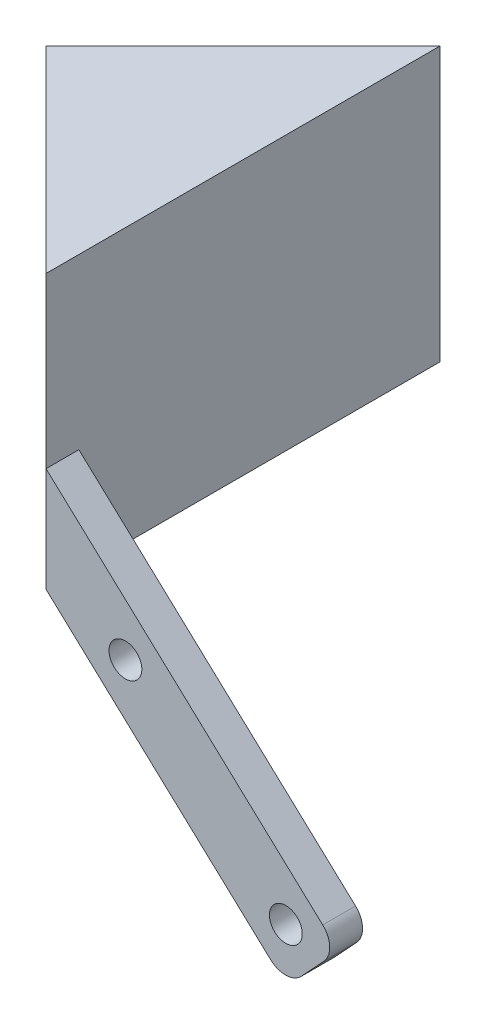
ISO-10303-21;
HEADER;
FILE_DESCRIPTION(('STEP AP214'),'2;1');
FILE_NAME('part.step','',(''),(''),'','','');
FILE_SCHEMA(('AUTOMOTIVE_DESIGN { 1 0 10303 214 1 1 1 1 }'));
ENDSEC;
DATA;
#1=APPLICATION_CONTEXT('core data for automotive mechanical design processes');
#2=APPLICATION_PROTOCOL_DEFINITION('international standard','automotive_design',2000,#1);
#3=PRODUCT_CONTEXT('',#1,'mechanical');
#4=PRODUCT('Part','Part','',(#3));
#5=PRODUCT_RELATED_PRODUCT_CATEGORY('part','',(#4));
#6=PRODUCT_DEFINITION_FORMATION('','',#4);
#7=PRODUCT_DEFINITION_CONTEXT('part definition',#1,'design');
#8=PRODUCT_DEFINITION('design','',#6,#7);
#9=PRODUCT_DEFINITION_SHAPE('','',#8);
#10=(LENGTH_UNIT() NAMED_UNIT(*) SI_UNIT(.MILLI.,.METRE.));
#11=(NAMED_UNIT(*) PLANE_ANGLE_UNIT() SI_UNIT($,.RADIAN.));
#12=(NAMED_UNIT(*) SI_UNIT($,.STERADIAN.) SOLID_ANGLE_UNIT());
#13=UNCERTAINTY_MEASURE_WITH_UNIT(LENGTH_MEASURE(1.E-05),#10,'distance_accuracy_value','');
#14=(GEOMETRIC_REPRESENTATION_CONTEXT(3) GLOBAL_UNCERTAINTY_ASSIGNED_CONTEXT((#13)) GLOBAL_UNIT_ASSIGNED_CONTEXT((#10,
#11,#12)) REPRESENTATION_CONTEXT('',''));
#15=CARTESIAN_POINT('',(0.,0.,0.));
#16=DIRECTION('',(0.,0.,1.));
#17=DIRECTION('',(1.,0.,0.));
#18=AXIS2_PLACEMENT_3D('',#15,#16,#17);
#19=CARTESIAN_POINT('',(0.,0.,3.));
#20=DIRECTION('',(0.,0.,1.));
#21=DIRECTION('',(1.,0.,0.));
#22=AXIS2_PLACEMENT_3D('',#19,#20,#21);
#23=PLANE('',#22);
#24=DIRECTION('',(0.732991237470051,-0.680238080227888,0.));
#25=VECTOR('',#24,1.);
#26=CARTESIAN_POINT('',(-17.467540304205,6.14774777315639,3.));
#27=LINE('',#26,#25);
#28=CARTESIAN_POINT('',(-17.467540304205,6.14774777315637,3.));
#29=VERTEX_POINT('',#28);
#30=CARTESIAN_POINT('',(3.05621434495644,-12.8989184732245,3.));
#31=VERTEX_POINT('',#30);
#32=EDGE_CURVE('E168',#29,#31,#27,.T.);
#33=ORIENTED_EDGE('',*,*,#32,.T.);
#34=CARTESIAN_POINT('',(4.41669050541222,-11.4329359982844,3.));
#35=DIRECTION('',(0.,0.,1.));
#36=DIRECTION('',(1.,0.,0.));
#37=AXIS2_PLACEMENT_3D('',#34,#35,#36);
#38=CIRCLE('',#37,2.);
#39=CARTESIAN_POINT('',(5.88267298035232,-12.7934121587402,3.));
#40=VERTEX_POINT('',#39);
#41=EDGE_CURVE('E48',#31,#40,#38,.T.);
#42=ORIENTED_EDGE('',*,*,#41,.T.);
#43=DIRECTION('',(0.680238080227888,0.732991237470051,0.));
#44=VECTOR('',#43,1.);
#45=CARTESIAN_POINT('',(9.28386338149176,-9.1284559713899,3.));
#46=LINE('',#45,#44);
#47=CARTESIAN_POINT('',(7.92338722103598,-10.59443844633,3.));
#48=VERTEX_POINT('',#47);
#49=EDGE_CURVE('E171',#40,#48,#46,.T.);
#50=ORIENTED_EDGE('',*,*,#49,.T.);
#51=CARTESIAN_POINT('',(6.45740474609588,-9.23396228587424,3.));
#52=DIRECTION('',(0.,0.,1.));
#53=DIRECTION('',(1.,0.,0.));
#54=AXIS2_PLACEMENT_3D('',#51,#52,#53);
#55=CIRCLE('',#54,2.);
#56=CARTESIAN_POINT('',(7.81788090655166,-7.76797981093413,3.));
#57=VERTEX_POINT('',#56);
#58=EDGE_CURVE('E55',#48,#57,#55,.T.);
#59=ORIENTED_EDGE('',*,*,#58,.T.);
#60=DIRECTION('',(-0.732991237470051,0.680238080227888,0.));
#61=VECTOR('',#60,1.);
#62=CARTESIAN_POINT('',(9.28386338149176,-9.1284559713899,3.));
#63=LINE('',#62,#61);
#64=CARTESIAN_POINT('',(-17.467540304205,15.6976572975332,3.));
#65=VERTEX_POINT('',#64);
#66=EDGE_CURVE('E175',#57,#65,#63,.T.);
#67=ORIENTED_EDGE('',*,*,#66,.T.);
#68=DIRECTION('',(0.,1.,0.));
#69=VECTOR('',#68,1.);
#70=CARTESIAN_POINT('',(-17.467540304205,6.14774777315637,3.));
#71=LINE('',#70,#69);
#72=EDGE_CURVE('E122',#29,#65,#71,.T.);
#73=ORIENTED_EDGE('',*,*,#72,.F.);
#74=EDGE_LOOP('',(#33,#42,#50,#59,#67,#73));
#75=FACE_BOUND('',#74,.T.);
#76=CARTESIAN_POINT('',(4.44750945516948,-9.41512773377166,3.));
#77=DIRECTION('',(0.,0.,1.));
#78=DIRECTION('',(1.,0.,0.));
#79=AXIS2_PLACEMENT_3D('',#76,#77,#78);
#80=CIRCLE('',#79,1.5);
#81=CARTESIAN_POINT('',(5.94750945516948,-9.41512773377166,3.));
#82=VERTEX_POINT('',#81);
#83=EDGE_CURVE('E160',#82,#82,#80,.T.);
#84=ORIENTED_EDGE('',*,*,#83,.F.);
#85=EDGE_LOOP('',(#84));
#86=FACE_BOUND('',#85,.T.);
#87=CARTESIAN_POINT('',(-10.2123152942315,4.18963387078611,3.));
#88=DIRECTION('',(0.,0.,1.));
#89=DIRECTION('',(1.,0.,0.));
#90=AXIS2_PLACEMENT_3D('',#87,#88,#89);
#91=CIRCLE('',#90,1.5);
#92=CARTESIAN_POINT('',(-8.71231529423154,4.18963387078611,3.));
#93=VERTEX_POINT('',#92);
#94=EDGE_CURVE('E152',#93,#93,#91,.T.);
#95=ORIENTED_EDGE('',*,*,#94,.F.);
#96=EDGE_LOOP('',(#95));
#97=FACE_BOUND('',#96,.T.);
#98=ADVANCED_FACE('F39',(#75,#86,#97),#23,.T.);
#99=CARTESIAN_POINT('',(0.,0.,0.));
#100=DIRECTION('',(0.,0.,1.));
#101=DIRECTION('',(1.,0.,0.));
#102=AXIS2_PLACEMENT_3D('',#99,#100,#101);
#103=PLANE('',#102);
#104=DIRECTION('',(0.680238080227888,0.732991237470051,0.));
#105=VECTOR('',#104,1.);
#106=CARTESIAN_POINT('',(9.28386338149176,-9.1284559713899,0.));
#107=LINE('',#106,#105);
#108=CARTESIAN_POINT('',(5.88267298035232,-12.7934121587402,0.));
#109=VERTEX_POINT('',#108);
#110=CARTESIAN_POINT('',(7.92338722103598,-10.59443844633,0.));
#111=VERTEX_POINT('',#110);
#112=EDGE_CURVE('E185',#109,#111,#107,.T.);
#113=ORIENTED_EDGE('',*,*,#112,.F.);
#114=CARTESIAN_POINT('',(4.41669050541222,-11.4329359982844,0.));
#115=DIRECTION('',(0.,0.,1.));
#116=DIRECTION('',(1.,0.,0.));
#117=AXIS2_PLACEMENT_3D('',#114,#115,#116);
#118=CIRCLE('',#117,2.);
#119=CARTESIAN_POINT('',(3.05621434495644,-12.8989184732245,0.));
#120=VERTEX_POINT('',#119);
#121=EDGE_CURVE('E208',#109,#120,#118,.F.);
#122=ORIENTED_EDGE('',*,*,#121,.T.);
#123=DIRECTION('',(0.732991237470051,-0.680238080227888,0.));
#124=VECTOR('',#123,1.);
#125=CARTESIAN_POINT('',(-17.467540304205,6.14774777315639,0.));
#126=LINE('',#125,#124);
#127=CARTESIAN_POINT('',(-17.467540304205,6.14774777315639,0.));
#128=VERTEX_POINT('',#127);
#129=EDGE_CURVE('E182',#128,#120,#126,.T.);
#130=ORIENTED_EDGE('',*,*,#129,.F.);
#131=DIRECTION('',(0.,-1.,0.));
#132=VECTOR('',#131,1.);
#133=CARTESIAN_POINT('',(-17.467540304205,15.6976572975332,0.));
#134=LINE('',#133,#132);
#135=CARTESIAN_POINT('',(-17.467540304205,15.6976572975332,0.));
#136=VERTEX_POINT('',#135);
#137=EDGE_CURVE('E164',#136,#128,#134,.T.);
#138=ORIENTED_EDGE('',*,*,#137,.F.);
#139=DIRECTION('',(-0.732991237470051,0.680238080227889,0.));
#140=VECTOR('',#139,1.);
#141=CARTESIAN_POINT('',(-12.7058737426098,11.2786864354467,0.));
#142=LINE('',#141,#140);
#143=CARTESIAN_POINT('',(7.81788090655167,-7.76797981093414,0.));
#144=VERTEX_POINT('',#143);
#145=EDGE_CURVE('E172',#144,#136,#142,.T.);
#146=ORIENTED_EDGE('',*,*,#145,.F.);
#147=CARTESIAN_POINT('',(6.45740474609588,-9.23396228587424,0.));
#148=DIRECTION('',(0.,0.,1.));
#149=DIRECTION('',(1.,0.,0.));
#150=AXIS2_PLACEMENT_3D('',#147,#148,#149);
#151=CIRCLE('',#150,2.);
#152=EDGE_CURVE('E205',#144,#111,#151,.F.);
#153=ORIENTED_EDGE('',*,*,#152,.T.);
#154=EDGE_LOOP('',(#113,#122,#130,#138,#146,#153));
#155=FACE_BOUND('',#154,.T.);
#156=CARTESIAN_POINT('',(4.44750945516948,-9.41512773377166,0.));
#157=DIRECTION('',(0.,0.,1.));
#158=DIRECTION('',(1.,0.,0.));
#159=AXIS2_PLACEMENT_3D('',#156,#157,#158);
#160=CIRCLE('',#159,1.5);
#161=CARTESIAN_POINT('',(5.94750945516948,-9.41512773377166,0.));
#162=VERTEX_POINT('',#161);
#163=EDGE_CURVE('E156',#162,#162,#160,.T.);
#164=ORIENTED_EDGE('',*,*,#163,.T.);
#165=EDGE_LOOP('',(#164));
#166=FACE_BOUND('',#165,.T.);
#167=CARTESIAN_POINT('',(-10.2123152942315,4.18963387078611,0.));
#168=DIRECTION('',(0.,0.,1.));
#169=DIRECTION('',(1.,0.,0.));
#170=AXIS2_PLACEMENT_3D('',#167,#168,#169);
#171=CIRCLE('',#170,1.5);
#172=CARTESIAN_POINT('',(-8.71231529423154,4.18963387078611,0.));
#173=VERTEX_POINT('',#172);
#174=EDGE_CURVE('E151',#173,#173,#171,.T.);
#175=ORIENTED_EDGE('',*,*,#174,.T.);
#176=EDGE_LOOP('',(#175));
#177=FACE_BOUND('',#176,.T.);
#178=ADVANCED_FACE('F227',(#155,#166,#177),#103,.F.);
#179=CARTESIAN_POINT('',(-17.467540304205,6.14774777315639,3.));
#180=DIRECTION('',(0.680238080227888,0.732991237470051,0.));
#181=DIRECTION('',(-0.732991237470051,0.680238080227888,0.));
#182=AXIS2_PLACEMENT_3D('',#179,#180,#181);
#183=PLANE('',#182);
#184=ORIENTED_EDGE('',*,*,#129,.T.);
#185=DIRECTION('',(0.,0.,-1.));
#186=VECTOR('',#185,1.);
#187=CARTESIAN_POINT('',(3.05621434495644,-12.8989184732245,3.));
#188=LINE('',#187,#186);
#189=EDGE_CURVE('E63',#120,#31,#188,.F.);
#190=ORIENTED_EDGE('',*,*,#189,.T.);
#191=ORIENTED_EDGE('',*,*,#32,.F.);
#192=DIRECTION('',(0.,0.,-1.));
#193=VECTOR('',#192,1.);
#194=CARTESIAN_POINT('',(-17.467540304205,6.14774777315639,3.));
#195=LINE('',#194,#193);
#196=EDGE_CURVE('E194',#29,#128,#195,.T.);
#197=ORIENTED_EDGE('',*,*,#196,.T.);
#198=EDGE_LOOP('',(#184,#190,#191,#197));
#199=FACE_BOUND('',#198,.T.);
#200=ADVANCED_FACE('F230',(#199),#183,.F.);
#201=CARTESIAN_POINT('',(9.28386338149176,-9.1284559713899,3.));
#202=DIRECTION('',(-0.732991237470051,0.680238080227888,0.));
#203=DIRECTION('',(-0.680238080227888,-0.732991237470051,0.));
#204=AXIS2_PLACEMENT_3D('',#201,#202,#203);
#205=PLANE('',#204);
#206=ORIENTED_EDGE('',*,*,#49,.F.);
#207=DIRECTION('',(0.,0.,-1.));
#208=VECTOR('',#207,1.);
#209=CARTESIAN_POINT('',(5.88267298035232,-12.7934121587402,3.));
#210=LINE('',#209,#208);
#211=EDGE_CURVE('E201',#40,#109,#210,.T.);
#212=ORIENTED_EDGE('',*,*,#211,.T.);
#213=ORIENTED_EDGE('',*,*,#112,.T.);
#214=DIRECTION('',(0.,0.,-1.));
#215=VECTOR('',#214,1.);
#216=CARTESIAN_POINT('',(7.92338722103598,-10.59443844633,3.));
#217=LINE('',#216,#215);
#218=EDGE_CURVE('E198',#111,#48,#217,.F.);
#219=ORIENTED_EDGE('',*,*,#218,.T.);
#220=EDGE_LOOP('',(#206,#212,#213,#219));
#221=FACE_BOUND('',#220,.T.);
#222=ADVANCED_FACE('F222',(#221),#205,.F.);
#223=CARTESIAN_POINT('',(-12.7058737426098,11.2786864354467,3.));
#224=DIRECTION('',(-0.680238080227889,-0.732991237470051,0.));
#225=DIRECTION('',(0.732991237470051,-0.680238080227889,0.));
#226=AXIS2_PLACEMENT_3D('',#223,#224,#225);
#227=PLANE('',#226);
#228=ORIENTED_EDGE('',*,*,#66,.F.);
#229=DIRECTION('',(0.,0.,-1.));
#230=VECTOR('',#229,1.);
#231=CARTESIAN_POINT('',(7.81788090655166,-7.76797981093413,3.));
#232=LINE('',#231,#230);
#233=EDGE_CURVE('E11',#57,#144,#232,.T.);
#234=ORIENTED_EDGE('',*,*,#233,.T.);
#235=ORIENTED_EDGE('',*,*,#145,.T.);
#236=DIRECTION('',(0.,0.,-1.));
#237=VECTOR('',#236,1.);
#238=CARTESIAN_POINT('',(-17.467540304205,15.6976572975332,3.));
#239=LINE('',#238,#237);
#240=EDGE_CURVE('E178',#65,#136,#239,.T.);
#241=ORIENTED_EDGE('',*,*,#240,.F.);
#242=EDGE_LOOP('',(#228,#234,#235,#241));
#243=FACE_BOUND('',#242,.T.);
#244=ADVANCED_FACE('F246',(#243),#227,.F.);
#245=CARTESIAN_POINT('',(4.44750945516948,-9.41512773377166,3.));
#246=DIRECTION('',(0.,0.,-1.));
#247=DIRECTION('',(-1.,0.,0.));
#248=AXIS2_PLACEMENT_3D('',#245,#246,#247);
#249=CYLINDRICAL_SURFACE('',#248,1.5);
#250=ORIENTED_EDGE('',*,*,#83,.T.);
#251=EDGE_LOOP('',(#250));
#252=FACE_BOUND('',#251,.T.);
#253=ORIENTED_EDGE('',*,*,#163,.F.);
#254=EDGE_LOOP('',(#253));
#255=FACE_BOUND('',#254,.T.);
#256=ADVANCED_FACE('F260',(#252,#255),#249,.F.);
#257=CARTESIAN_POINT('',(-10.2123152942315,4.18963387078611,3.));
#258=DIRECTION('',(0.,0.,-1.));
#259=DIRECTION('',(-1.,0.,0.));
#260=AXIS2_PLACEMENT_3D('',#257,#258,#259);
#261=CYLINDRICAL_SURFACE('',#260,1.5);
#262=ORIENTED_EDGE('',*,*,#94,.T.);
#263=EDGE_LOOP('',(#262));
#264=FACE_BOUND('',#263,.T.);
#265=ORIENTED_EDGE('',*,*,#174,.F.);
#266=EDGE_LOOP('',(#265));
#267=FACE_BOUND('',#266,.T.);
#268=ADVANCED_FACE('F287',(#264,#267),#261,.F.);
#269=CARTESIAN_POINT('',(-35.467540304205,31.1477477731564,-33.));
#270=DIRECTION('',(0.,-1.,0.));
#271=DIRECTION('',(0.,0.,-1.));
#272=AXIS2_PLACEMENT_3D('',#269,#270,#271);
#273=PLANE('',#272);
#274=DIRECTION('',(0.,0.,-1.));
#275=VECTOR('',#274,1.);
#276=CARTESIAN_POINT('',(-17.467540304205,31.1477477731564,-33.));
#277=LINE('',#276,#275);
#278=CARTESIAN_POINT('',(-17.467540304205,31.1477477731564,3.));
#279=VERTEX_POINT('',#278);
#280=CARTESIAN_POINT('',(-17.467540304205,31.1477477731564,-33.));
#281=VERTEX_POINT('',#280);
#282=EDGE_CURVE('E128',#279,#281,#277,.T.);
#283=ORIENTED_EDGE('',*,*,#282,.T.);
#284=DIRECTION('',(0.707106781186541,0.,-0.707106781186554));
#285=VECTOR('',#284,1.);
#286=CARTESIAN_POINT('',(-17.467540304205,31.1477477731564,-33.));
#287=LINE('',#286,#285);
#288=CARTESIAN_POINT('',(-35.4675403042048,31.1477477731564,-14.9999999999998));
#289=VERTEX_POINT('',#288);
#290=EDGE_CURVE('E113',#289,#281,#287,.T.);
#291=ORIENTED_EDGE('',*,*,#290,.F.);
#292=DIRECTION('',(0.707106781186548,0.,0.707106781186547));
#293=VECTOR('',#292,1.);
#294=CARTESIAN_POINT('',(-44.467540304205,31.1477477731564,-24.));
#295=LINE('',#294,#293);
#296=EDGE_CURVE('E121',#289,#279,#295,.T.);
#297=ORIENTED_EDGE('',*,*,#296,.T.);
#298=EDGE_LOOP('',(#283,#291,#297));
#299=FACE_BOUND('',#298,.T.);
#300=ADVANCED_FACE('F126',(#299),#273,.F.);
#301=CARTESIAN_POINT('',(-35.467540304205,6.14774777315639,3.));
#302=DIRECTION('',(0.,1.,0.));
#303=DIRECTION('',(0.,0.,1.));
#304=AXIS2_PLACEMENT_3D('',#301,#302,#303);
#305=PLANE('',#304);
#306=DIRECTION('',(-0.707106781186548,0.,-0.707106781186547));
#307=VECTOR('',#306,1.);
#308=CARTESIAN_POINT('',(-10.2337701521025,6.14774777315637,10.2337701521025));
#309=LINE('',#308,#307);
#310=CARTESIAN_POINT('',(-35.467540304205,6.14774777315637,-15.));
#311=VERTEX_POINT('',#310);
#312=EDGE_CURVE('E239',#29,#311,#309,.T.);
#313=ORIENTED_EDGE('',*,*,#312,.T.);
#314=DIRECTION('',(0.707106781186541,0.,-0.707106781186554));
#315=VECTOR('',#314,1.);
#316=CARTESIAN_POINT('',(-44.4675403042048,6.14774777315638,-5.99999999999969));
#317=LINE('',#316,#315);
#318=CARTESIAN_POINT('',(-17.467540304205,6.14774777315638,-33.));
#319=VERTEX_POINT('',#318);
#320=EDGE_CURVE('E116',#311,#319,#317,.T.);
#321=ORIENTED_EDGE('',*,*,#320,.T.);
#322=DIRECTION('',(0.,0.,1.));
#323=VECTOR('',#322,1.);
#324=CARTESIAN_POINT('',(-17.467540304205,6.14774777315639,3.));
#325=LINE('',#324,#323);
#326=EDGE_CURVE('E147',#319,#128,#325,.T.);
#327=ORIENTED_EDGE('',*,*,#326,.T.);
#328=ORIENTED_EDGE('',*,*,#196,.F.);
#329=EDGE_LOOP('',(#313,#321,#327,#328));
#330=FACE_BOUND('',#329,.T.);
#331=ADVANCED_FACE('F238',(#330),#305,.F.);
#332=CARTESIAN_POINT('',(-17.467540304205,0.,0.));
#333=DIRECTION('',(1.,0.,0.));
#334=DIRECTION('',(0.,0.,-1.));
#335=AXIS2_PLACEMENT_3D('',#332,#333,#334);
#336=PLANE('',#335);
#337=ORIENTED_EDGE('',*,*,#240,.T.);
#338=ORIENTED_EDGE('',*,*,#137,.T.);
#339=ORIENTED_EDGE('',*,*,#326,.F.);
#340=DIRECTION('',(0.,-1.,0.));
#341=VECTOR('',#340,1.);
#342=CARTESIAN_POINT('',(-17.467540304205,6.14774777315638,-33.));
#343=LINE('',#342,#341);
#344=EDGE_CURVE('E144',#281,#319,#343,.T.);
#345=ORIENTED_EDGE('',*,*,#344,.F.);
#346=ORIENTED_EDGE('',*,*,#282,.F.);
#347=DIRECTION('',(0.,1.,0.));
#348=VECTOR('',#347,1.);
#349=CARTESIAN_POINT('',(-17.467540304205,31.1477477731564,3.));
#350=LINE('',#349,#348);
#351=EDGE_CURVE('E135',#65,#279,#350,.T.);
#352=ORIENTED_EDGE('',*,*,#351,.F.);
#353=EDGE_LOOP('',(#337,#338,#339,#345,#346,#352));
#354=FACE_BOUND('',#353,.T.);
#355=ADVANCED_FACE('F235',(#354),#336,.T.);
#356=CARTESIAN_POINT('',(-10.2337701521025,6.14774777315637,10.2337701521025));
#357=DIRECTION('',(0.707106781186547,0.,-0.707106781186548));
#358=DIRECTION('',(-0.707106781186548,0.,-0.707106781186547));
#359=AXIS2_PLACEMENT_3D('',#356,#357,#358);
#360=PLANE('',#359);
#361=DIRECTION('',(0.,1.,0.));
#362=VECTOR('',#361,1.);
#363=CARTESIAN_POINT('',(-35.467540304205,6.14774777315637,-15.));
#364=LINE('',#363,#362);
#365=EDGE_CURVE('E110',#311,#289,#364,.T.);
#366=ORIENTED_EDGE('',*,*,#365,.F.);
#367=ORIENTED_EDGE('',*,*,#312,.F.);
#368=ORIENTED_EDGE('',*,*,#72,.T.);
#369=ORIENTED_EDGE('',*,*,#351,.T.);
#370=ORIENTED_EDGE('',*,*,#296,.F.);
#371=EDGE_LOOP('',(#366,#367,#368,#369,#370));
#372=FACE_BOUND('',#371,.T.);
#373=ADVANCED_FACE('F132',(#372),#360,.F.);
#374=CARTESIAN_POINT('',(-17.467540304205,5.14774777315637,-33.));
#375=DIRECTION('',(0.707106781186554,0.,0.707106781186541));
#376=DIRECTION('',(0.707106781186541,0.,-0.707106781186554));
#377=AXIS2_PLACEMENT_3D('',#374,#375,#376);
#378=PLANE('',#377);
#379=ORIENTED_EDGE('',*,*,#365,.T.);
#380=ORIENTED_EDGE('',*,*,#290,.T.);
#381=ORIENTED_EDGE('',*,*,#344,.T.);
#382=ORIENTED_EDGE('',*,*,#320,.F.);
#383=EDGE_LOOP('',(#379,#380,#381,#382));
#384=FACE_BOUND('',#383,.T.);
#385=ADVANCED_FACE('F112',(#384),#378,.F.);
#386=CARTESIAN_POINT('',(4.41669050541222,-11.4329359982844,3.));
#387=DIRECTION('',(0.,0.,-1.));
#388=DIRECTION('',(-1.,0.,0.));
#389=AXIS2_PLACEMENT_3D('',#386,#387,#388);
#390=CYLINDRICAL_SURFACE('',#389,2.);
#391=ORIENTED_EDGE('',*,*,#41,.F.);
#392=ORIENTED_EDGE('',*,*,#189,.F.);
#393=ORIENTED_EDGE('',*,*,#121,.F.);
#394=ORIENTED_EDGE('',*,*,#211,.F.);
#395=EDGE_LOOP('',(#391,#392,#393,#394));
#396=FACE_BOUND('',#395,.T.);
#397=ADVANCED_FACE('F225',(#396),#390,.T.);
#398=CARTESIAN_POINT('',(6.45740474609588,-9.23396228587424,3.));
#399=DIRECTION('',(0.,0.,-1.));
#400=DIRECTION('',(-1.,0.,0.));
#401=AXIS2_PLACEMENT_3D('',#398,#399,#400);
#402=CYLINDRICAL_SURFACE('',#401,2.);
#403=ORIENTED_EDGE('',*,*,#58,.F.);
#404=ORIENTED_EDGE('',*,*,#218,.F.);
#405=ORIENTED_EDGE('',*,*,#152,.F.);
#406=ORIENTED_EDGE('',*,*,#233,.F.);
#407=EDGE_LOOP('',(#403,#404,#405,#406));
#408=FACE_BOUND('',#407,.T.);
#409=ADVANCED_FACE('F41',(#408),#402,.T.);
#410=CLOSED_SHELL('',(#98,#178,#200,#222,#244,#256,#268,#300,#331,#355,#373,#385,#397,#409));
#411=MANIFOLD_SOLID_BREP('B2',#410);
#412=ADVANCED_BREP_SHAPE_REPRESENTATION('',(#18,#411),#14);
#413=SHAPE_DEFINITION_REPRESENTATION(#9,#412);
ENDSEC;
END-ISO-10303-21;
